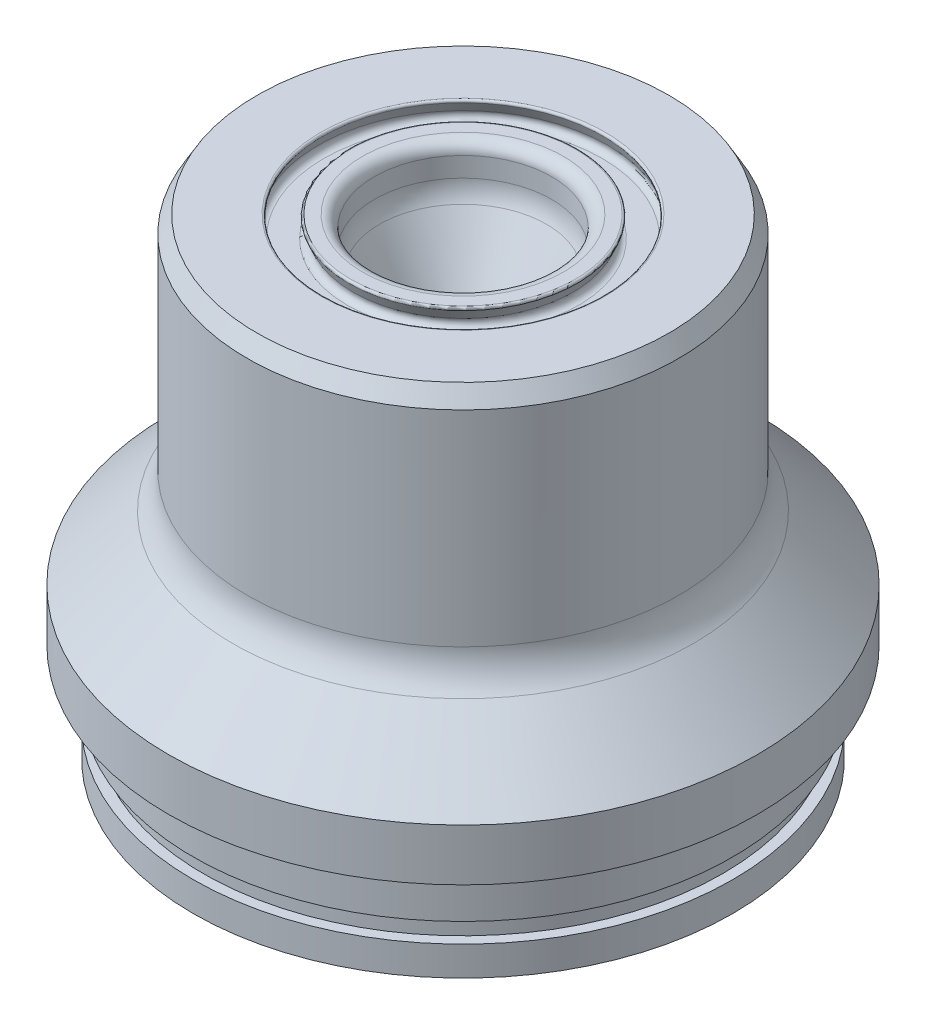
from build123d import *

# Parameters (mm, degrees)
CUT_SWEEP2_PROFILE_R = 0.9906
CHAMFER1_SIZE        = 0.635
CHAMFER1_SIZE2       = 1.099852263
CHAMFER2_SIZE        = 1.27
CHAMFER2_SIZE2       = 0.733234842
FILLET2_R            = 3.175
FILLET3_R            = 6.35
BOSS_EXTRUDE2_DEPTH  = 3.175
FILLET4_R            = 6.35


with BuildPart() as part:
    # Sketch2 → sink (revolve)
    with BuildSketch(Plane.XY, mode=Mode.PRIVATE) as sink_sk:
        with BuildLine():
            Line((9.083842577, -0.686655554), (9.366405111, -1.321301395))
            ThreePointArc((9.366405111, -1.321301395), (9.336689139, -1.698878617), (9.003841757, -1.8796))
            Line((9.003841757, -1.8796), (7.480758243, -1.8796))
            ThreePointArc((7.480758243, -1.8796), (7.147910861, -1.698878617), (7.118194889, -1.321301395))
            Line((7.118194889, -1.321301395), (7.400757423, -0.686655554))
            ThreePointArc((7.400757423, -0.686655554), (7.391248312, -0.565830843), (7.28473715, -0.508))
            Line((7.28473715, -0.508), (6.498785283, -0.508))
            ThreePointArc((6.498785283, -0.508), (5.959969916, -0.731184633), (5.736785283, -1.27))
            Line((5.736785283, -1.27), (5.736785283, -2.54))
            ThreePointArc((5.736785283, -2.54), (5.65477702, -3.180216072), (5.414047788, -3.779091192))
            Line((5.414047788, -3.779091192), (0.9906, -11.694525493))
            Line((0.9906, -11.694525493), (0, -11.694525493))
            Line((0, -11.694525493), (0, -16.2052))
            Line((0, -16.2052), (13.97, -16.2052))
            Line((13.97, -16.2052), (13.97, -0.508))
            Line((13.97, -0.508), (9.19986285, -0.508))
            ThreePointArc((9.19986285, -0.508), (9.093351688, -0.565830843), (9.083842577, -0.686655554))
        make_face()
    revolve(sink_sk.sketch.rotate(Axis((0, -0.508, 0), (0, -1, 0)), 90), axis=Axis((0, -0.508, 0), (0, -1, 0)))

    # Cut-Sweep2: sweep along a path in Sketch12
    with BuildLine(Plane.XY) as cut_sweep2_path:
        Line((0, -11.694525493), (0, -16.2052))
    # Cut-Sweep2 profile (on start of the path) → Cut-Sweep2 (sweep, cut)
    with BuildSketch(Plane(origin=(0, -11.694525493, 0), x_dir=(-1, 0, 0), z_dir=(0, -1, 0))):
        Circle(CUT_SWEEP2_PROFILE_R)
    sweep(path=cut_sweep2_path.line, mode=Mode.SUBTRACT)

    # Chamfer1
    chamfer1_edges = [part.edges().sort_by_distance(p)[0] for p in [
        (0, -0.508, -13.97),
    ]]
    chamfer1_side = [part.faces().sort_by_distance(p)[0] for p in [
        (0, -0.508, -13.574868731),
    ]]
    chamfer(chamfer1_edges, length=CHAMFER1_SIZE, length2=CHAMFER1_SIZE2, reference=chamfer1_side[0])

    # Sketch42 → Revolve1 (revolve)
    with BuildSketch(Plane.XY):
        Polygon((-15.24, -21.067302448), (-15.24, -30.988), (-17.4625, -30.988), (-17.4625, -29.083), (-16.8021, -29.083), (-16.8021, -27.813), (-17.4625, -27.813), (-17.4625, -24.638), (-19.05, -24.638), (-19.05, -21.2852), (-13.97, -16.2052), (-10.377897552, -16.2052), align=None)
    revolve(axis=Axis((0, 0, 0), (0, -1, 0)))

    # Sketch43 → Revolve2 (revolve)
    with BuildSketch(Plane.XY):
        with BuildLine():
            Line((-0.9906, -16.2052), (-0.9906, -25.3492))
            Line((-0.9906, -25.3492), (-1.397, -25.3492))
            ThreePointArc((-1.397, -25.3492), (-1.576605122, -25.274805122), (-1.651, -25.0952))
            Line((-1.651, -25.0952), (-1.651, -24.3332))
            Line((-1.651, -24.3332), (-2.286, -20.7772))
            Line((-2.286, -20.7772), (-1.778, -20.7772))
            Line((-1.778, -20.7772), (-1.778, -16.2052))
            Line((-1.778, -16.2052), (-0.9906, -16.2052))
        make_face()
    revolve(axis=Axis((0, -16.2052, 0), (0, -1, 0)))

    # Chamfer2
    chamfer2_edges = [part.edges().sort_by_distance(p)[0] for p in [
        (1.778, -16.2052, 0),
    ]]
    chamfer2_side = [part.faces().sort_by_distance(p)[0] for p in [
        (1.778, -18.4912, 0),
    ]]
    chamfer(chamfer2_edges, length=CHAMFER2_SIZE, length2=CHAMFER2_SIZE2, reference=chamfer2_side[0])

    # Fillet2
    fillet2_edges = [part.edges().sort_by_distance(p)[0] for p in [
        (9.878281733, -16.2052, -9.878281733),
    ]]
    fillet(fillet2_edges, radius=FILLET2_R)

    # Fillet3
    fillet3_edges = [part.edges().sort_by_distance(p)[0] for p in [
        (10.377897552, -16.2052, 0),
    ]]
    fillet(fillet3_edges, radius=FILLET3_R)

    # Sketch46 → Boss-Extrude2 (add)
    with BuildSketch(Plane.XZ.offset(24.638)):
        with BuildLine():
            Line((-18.05, 0.9), (-17.439292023, 0.9))
            ThreePointArc((-17.439292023, 0.9), (-17.4625, 0), (-17.439292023, -0.9))
            Line((-17.439292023, -0.9), (-18.05, -0.9))
            ThreePointArc((-18.05, -0.9), (-18.95, 0), (-18.05, 0.9))
        make_face()
    extrude(amount=BOSS_EXTRUDE2_DEPTH)

    # Fillet4
    fillet4_edges = [part.edges().sort_by_distance(p)[0] for p in [
        (15.24, -21.067302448, 0),
    ]]
    fillet(fillet4_edges, radius=FILLET4_R)


solid = part.part
